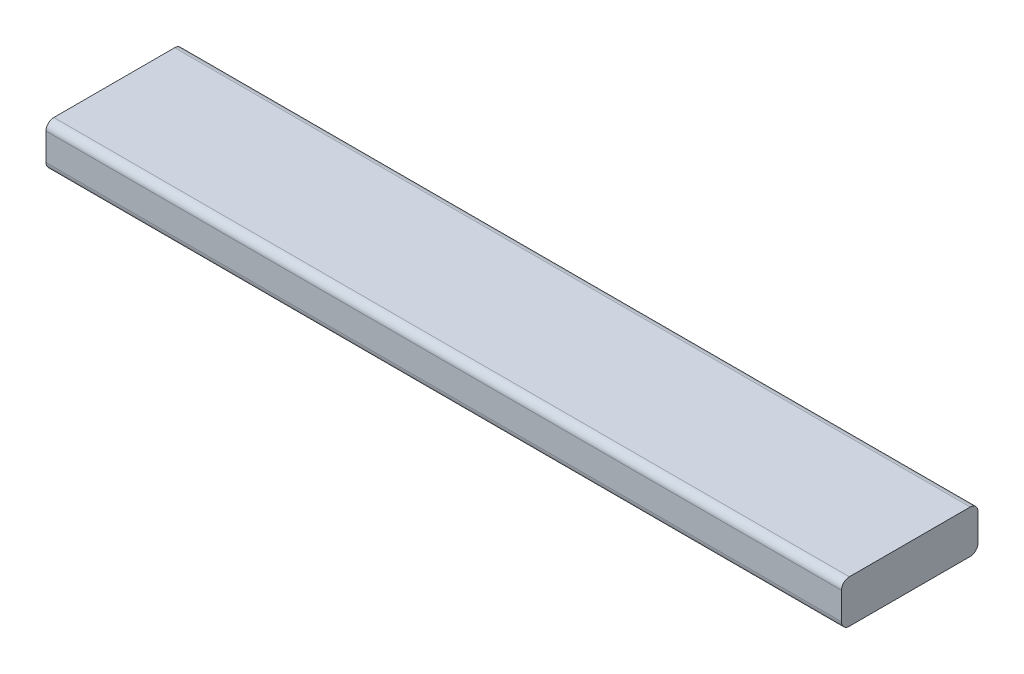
from build123d import *

# Parameters (mm, degrees)
SKETCH2_W           = 111.125
SKETCH2_H           = 34.925
BOSS_EXTRUDE1_DEPTH = 647.7
FILLET1_R           = 6.35


with BuildPart() as part:
    # Sketch2 → Boss-Extrude1 (new body)
    with BuildSketch(Plane(origin=(0, 0, 0), x_dir=(0, 0, -1), z_dir=(1, 0, 0))):
        with Locations((-55.5625, 17.4625)):
            Rectangle(SKETCH2_W, SKETCH2_H)
    extrude(amount=BOSS_EXTRUDE1_DEPTH)

    # Fillet1
    fillet1_edges = [part.edges().sort_by_distance(p)[0] for p in [
        (323.85, 34.925, 111.125),
        (323.85, 0, 111.125),
        (323.85, 0, 0),
        (323.85, 34.925, 0),
    ]]
    fillet(fillet1_edges, radius=FILLET1_R)


solid = part.part
